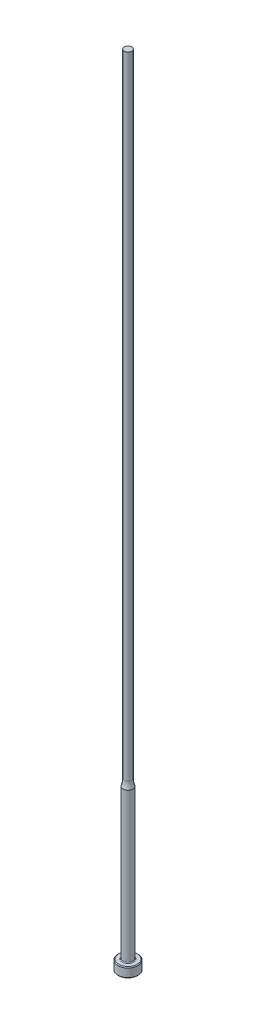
ISO-10303-21;
HEADER;
FILE_DESCRIPTION(('STEP AP214'),'2;1');
FILE_NAME('part.step','',(''),(''),'','','');
FILE_SCHEMA(('AUTOMOTIVE_DESIGN { 1 0 10303 214 1 1 1 1 }'));
ENDSEC;
DATA;
#1=APPLICATION_CONTEXT('core data for automotive mechanical design processes');
#2=APPLICATION_PROTOCOL_DEFINITION('international standard','automotive_design',2000,#1);
#3=PRODUCT_CONTEXT('',#1,'mechanical');
#4=PRODUCT('Part','Part','',(#3));
#5=PRODUCT_RELATED_PRODUCT_CATEGORY('part','',(#4));
#6=PRODUCT_DEFINITION_FORMATION('','',#4);
#7=PRODUCT_DEFINITION_CONTEXT('part definition',#1,'design');
#8=PRODUCT_DEFINITION('design','',#6,#7);
#9=PRODUCT_DEFINITION_SHAPE('','',#8);
#10=(LENGTH_UNIT() NAMED_UNIT(*) SI_UNIT(.MILLI.,.METRE.));
#11=(NAMED_UNIT(*) PLANE_ANGLE_UNIT() SI_UNIT($,.RADIAN.));
#12=(NAMED_UNIT(*) SI_UNIT($,.STERADIAN.) SOLID_ANGLE_UNIT());
#13=UNCERTAINTY_MEASURE_WITH_UNIT(LENGTH_MEASURE(1.E-05),#10,'distance_accuracy_value','');
#14=(GEOMETRIC_REPRESENTATION_CONTEXT(3) GLOBAL_UNCERTAINTY_ASSIGNED_CONTEXT((#13)) GLOBAL_UNIT_ASSIGNED_CONTEXT((#10,
#11,#12)) REPRESENTATION_CONTEXT('',''));
#15=CARTESIAN_POINT('',(0.,0.,0.));
#16=DIRECTION('',(0.,0.,1.));
#17=DIRECTION('',(1.,0.,0.));
#18=AXIS2_PLACEMENT_3D('',#15,#16,#17);
#19=CARTESIAN_POINT('',(-1.18998999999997,254.,0.));
#20=DIRECTION('',(0.,1.,0.));
#21=DIRECTION('',(0.,0.,1.));
#22=AXIS2_PLACEMENT_3D('',#19,#20,#21);
#23=PLANE('',#22);
#24=CARTESIAN_POINT('',(0.,254.,0.));
#25=DIRECTION('',(0.,1.,0.));
#26=DIRECTION('',(0.,0.,1.));
#27=AXIS2_PLACEMENT_3D('',#24,#25,#26);
#28=CIRCLE('',#27,1.18998999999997);
#29=CARTESIAN_POINT('',(0.,254.,1.18998999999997));
#30=VERTEX_POINT('',#29);
#31=EDGE_CURVE('E56',#30,#30,#28,.T.);
#32=ORIENTED_EDGE('',*,*,#31,.T.);
#33=EDGE_LOOP('',(#32));
#34=FACE_BOUND('',#33,.T.);
#35=ADVANCED_FACE('F30',(#34),#23,.T.);
#36=CARTESIAN_POINT('',(0.,259.958771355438,0.));
#37=DIRECTION('',(0.,1.,0.));
#38=DIRECTION('',(0.,0.,1.));
#39=AXIS2_PLACEMENT_3D('',#36,#37,#38);
#40=CYLINDRICAL_SURFACE('',#39,1.18998999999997);
#41=CARTESIAN_POINT('',(0.,53.0114164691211,0.));
#42=DIRECTION('',(0.,1.,0.));
#43=DIRECTION('',(0.,0.,1.));
#44=AXIS2_PLACEMENT_3D('',#41,#42,#43);
#45=CIRCLE('',#44,1.18998999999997);
#46=CARTESIAN_POINT('',(0.,53.0114164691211,1.18998999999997));
#47=VERTEX_POINT('',#46);
#48=EDGE_CURVE('E59',#47,#47,#45,.T.);
#49=ORIENTED_EDGE('',*,*,#48,.T.);
#50=EDGE_LOOP('',(#49));
#51=FACE_BOUND('',#50,.T.);
#52=ORIENTED_EDGE('',*,*,#31,.F.);
#53=EDGE_LOOP('',(#52));
#54=FACE_BOUND('',#53,.T.);
#55=ADVANCED_FACE('F79',(#51,#54),#40,.T.);
#56=CARTESIAN_POINT('',(0.,53.0114164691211,0.));
#57=DIRECTION('',(0.,1.,0.));
#58=DIRECTION('',(0.,0.,1.));
#59=AXIS2_PLACEMENT_3D('',#56,#57,#58);
#60=TOROIDAL_SURFACE('',#59,7.53998999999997,6.35);
#61=CARTESIAN_POINT('',(0.,50.8,0.));
#62=DIRECTION('',(0.,1.,0.));
#63=DIRECTION('',(0.,0.,1.));
#64=AXIS2_PLACEMENT_3D('',#61,#62,#63);
#65=CIRCLE('',#64,1.58749999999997);
#66=CARTESIAN_POINT('',(0.,50.8,1.58749999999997));
#67=VERTEX_POINT('',#66);
#68=EDGE_CURVE('E62',#67,#67,#65,.T.);
#69=ORIENTED_EDGE('',*,*,#68,.T.);
#70=EDGE_LOOP('',(#69));
#71=FACE_BOUND('',#70,.T.);
#72=ORIENTED_EDGE('',*,*,#48,.F.);
#73=EDGE_LOOP('',(#72));
#74=FACE_BOUND('',#73,.T.);
#75=ADVANCED_FACE('F66',(#71,#74),#60,.F.);
#76=CARTESIAN_POINT('',(0.,259.958771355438,0.));
#77=DIRECTION('',(0.,1.,0.));
#78=DIRECTION('',(0.,0.,1.));
#79=AXIS2_PLACEMENT_3D('',#76,#77,#78);
#80=CYLINDRICAL_SURFACE('',#79,1.58749999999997);
#81=CARTESIAN_POINT('',(0.,3.42900000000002,0.));
#82=DIRECTION('',(0.,1.,0.));
#83=DIRECTION('',(0.,0.,1.));
#84=AXIS2_PLACEMENT_3D('',#81,#82,#83);
#85=CIRCLE('',#84,1.58749999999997);
#86=CARTESIAN_POINT('',(0.,3.42900000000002,1.58749999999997));
#87=VERTEX_POINT('',#86);
#88=EDGE_CURVE('E37',#87,#87,#85,.T.);
#89=ORIENTED_EDGE('',*,*,#88,.T.);
#90=EDGE_LOOP('',(#89));
#91=FACE_BOUND('',#90,.T.);
#92=ORIENTED_EDGE('',*,*,#68,.F.);
#93=EDGE_LOOP('',(#92));
#94=FACE_BOUND('',#93,.T.);
#95=ADVANCED_FACE('F69',(#91,#94),#80,.T.);
#96=CARTESIAN_POINT('',(-3.17499999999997,3.175,0.));
#97=DIRECTION('',(0.,1.,0.));
#98=DIRECTION('',(0.,0.,1.));
#99=AXIS2_PLACEMENT_3D('',#96,#97,#98);
#100=PLANE('',#99);
#101=CARTESIAN_POINT('',(0.,3.175,0.));
#102=DIRECTION('',(0.,1.,0.));
#103=DIRECTION('',(0.,0.,1.));
#104=AXIS2_PLACEMENT_3D('',#101,#102,#103);
#105=CIRCLE('',#104,1.84149999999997);
#106=CARTESIAN_POINT('',(0.,3.175,1.84149999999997));
#107=VERTEX_POINT('',#106);
#108=EDGE_CURVE('E10',#107,#107,#105,.F.);
#109=ORIENTED_EDGE('',*,*,#108,.T.);
#110=EDGE_LOOP('',(#109));
#111=FACE_BOUND('',#110,.T.);
#112=CARTESIAN_POINT('',(0.,3.175,0.));
#113=DIRECTION('',(0.,1.,0.));
#114=DIRECTION('',(0.,0.,1.));
#115=AXIS2_PLACEMENT_3D('',#112,#113,#114);
#116=CIRCLE('',#115,2.92099999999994);
#117=CARTESIAN_POINT('',(0.,3.175,2.92099999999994));
#118=VERTEX_POINT('',#117);
#119=EDGE_CURVE('E53',#118,#118,#116,.T.);
#120=ORIENTED_EDGE('',*,*,#119,.T.);
#121=EDGE_LOOP('',(#120));
#122=FACE_BOUND('',#121,.T.);
#123=ADVANCED_FACE('F71',(#111,#122),#100,.T.);
#124=CARTESIAN_POINT('',(0.,259.958771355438,0.));
#125=DIRECTION('',(0.,1.,0.));
#126=DIRECTION('',(0.,0.,1.));
#127=AXIS2_PLACEMENT_3D('',#124,#125,#126);
#128=CYLINDRICAL_SURFACE('',#127,3.17499999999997);
#129=CARTESIAN_POINT('',(0.,2.92100000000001,0.));
#130=DIRECTION('',(0.,1.,0.));
#131=DIRECTION('',(0.,0.,1.));
#132=AXIS2_PLACEMENT_3D('',#129,#130,#131);
#133=CIRCLE('',#132,3.17499999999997);
#134=CARTESIAN_POINT('',(0.,2.92100000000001,3.17499999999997));
#135=VERTEX_POINT('',#134);
#136=EDGE_CURVE('E45',#135,#135,#133,.F.);
#137=ORIENTED_EDGE('',*,*,#136,.T.);
#138=EDGE_LOOP('',(#137));
#139=FACE_BOUND('',#138,.T.);
#140=CARTESIAN_POINT('',(0.,0.253999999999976,0.));
#141=DIRECTION('',(0.,-1.,0.));
#142=DIRECTION('',(0.,0.,-1.));
#143=AXIS2_PLACEMENT_3D('',#140,#141,#142);
#144=CIRCLE('',#143,3.17499999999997);
#145=CARTESIAN_POINT('',(0.,0.253999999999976,-3.17499999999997));
#146=VERTEX_POINT('',#145);
#147=EDGE_CURVE('E50',#146,#146,#144,.F.);
#148=ORIENTED_EDGE('',*,*,#147,.T.);
#149=EDGE_LOOP('',(#148));
#150=FACE_BOUND('',#149,.T.);
#151=ADVANCED_FACE('F77',(#139,#150),#128,.T.);
#152=CARTESIAN_POINT('',(0.,0.,0.));
#153=DIRECTION('',(0.,-1.,0.));
#154=DIRECTION('',(0.,0.,-1.));
#155=AXIS2_PLACEMENT_3D('',#152,#153,#154);
#156=PLANE('',#155);
#157=CARTESIAN_POINT('',(0.,0.,0.));
#158=DIRECTION('',(0.,-1.,0.));
#159=DIRECTION('',(0.,0.,-1.));
#160=AXIS2_PLACEMENT_3D('',#157,#158,#159);
#161=CIRCLE('',#160,2.92100000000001);
#162=CARTESIAN_POINT('',(0.,0.,-2.92100000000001));
#163=VERTEX_POINT('',#162);
#164=EDGE_CURVE('E41',#163,#163,#161,.T.);
#165=ORIENTED_EDGE('',*,*,#164,.T.);
#166=EDGE_LOOP('',(#165));
#167=FACE_BOUND('',#166,.T.);
#168=ADVANCED_FACE('F93',(#167),#156,.T.);
#169=CARTESIAN_POINT('',(0.,3.17499999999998,0.));
#170=DIRECTION('',(0.,-1.,0.));
#171=DIRECTION('',(0.,0.,-1.));
#172=AXIS2_PLACEMENT_3D('',#169,#170,#171);
#173=CONICAL_SURFACE('',#172,2.92099999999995,0.785398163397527);
#174=ORIENTED_EDGE('',*,*,#136,.F.);
#175=EDGE_LOOP('',(#174));
#176=FACE_BOUND('',#175,.T.);
#177=ORIENTED_EDGE('',*,*,#119,.F.);
#178=EDGE_LOOP('',(#177));
#179=FACE_BOUND('',#178,.T.);
#180=ADVANCED_FACE('F90',(#176,#179),#173,.T.);
#181=CARTESIAN_POINT('',(0.,0.253999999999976,0.));
#182=DIRECTION('',(0.,1.,0.));
#183=DIRECTION('',(0.,0.,1.));
#184=AXIS2_PLACEMENT_3D('',#181,#182,#183);
#185=CONICAL_SURFACE('',#184,3.17499999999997,0.785398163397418);
#186=ORIENTED_EDGE('',*,*,#164,.F.);
#187=EDGE_LOOP('',(#186));
#188=FACE_BOUND('',#187,.T.);
#189=ORIENTED_EDGE('',*,*,#147,.F.);
#190=EDGE_LOOP('',(#189));
#191=FACE_BOUND('',#190,.T.);
#192=ADVANCED_FACE('F92',(#188,#191),#185,.T.);
#193=CARTESIAN_POINT('',(0.,3.42900000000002,0.));
#194=DIRECTION('',(0.,1.,0.));
#195=DIRECTION('',(0.,0.,1.));
#196=AXIS2_PLACEMENT_3D('',#193,#194,#195);
#197=TOROIDAL_SURFACE('',#196,1.84149999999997,0.254);
#198=ORIENTED_EDGE('',*,*,#108,.F.);
#199=EDGE_LOOP('',(#198));
#200=FACE_BOUND('',#199,.T.);
#201=ORIENTED_EDGE('',*,*,#88,.F.);
#202=EDGE_LOOP('',(#201));
#203=FACE_BOUND('',#202,.T.);
#204=ADVANCED_FACE('F32',(#200,#203),#197,.F.);
#205=CLOSED_SHELL('',(#35,#55,#75,#95,#123,#151,#168,#180,#192,#204));
#206=MANIFOLD_SOLID_BREP('B2',#205);
#207=ADVANCED_BREP_SHAPE_REPRESENTATION('',(#18,#206),#14);
#208=SHAPE_DEFINITION_REPRESENTATION(#9,#207);
ENDSEC;
END-ISO-10303-21;
